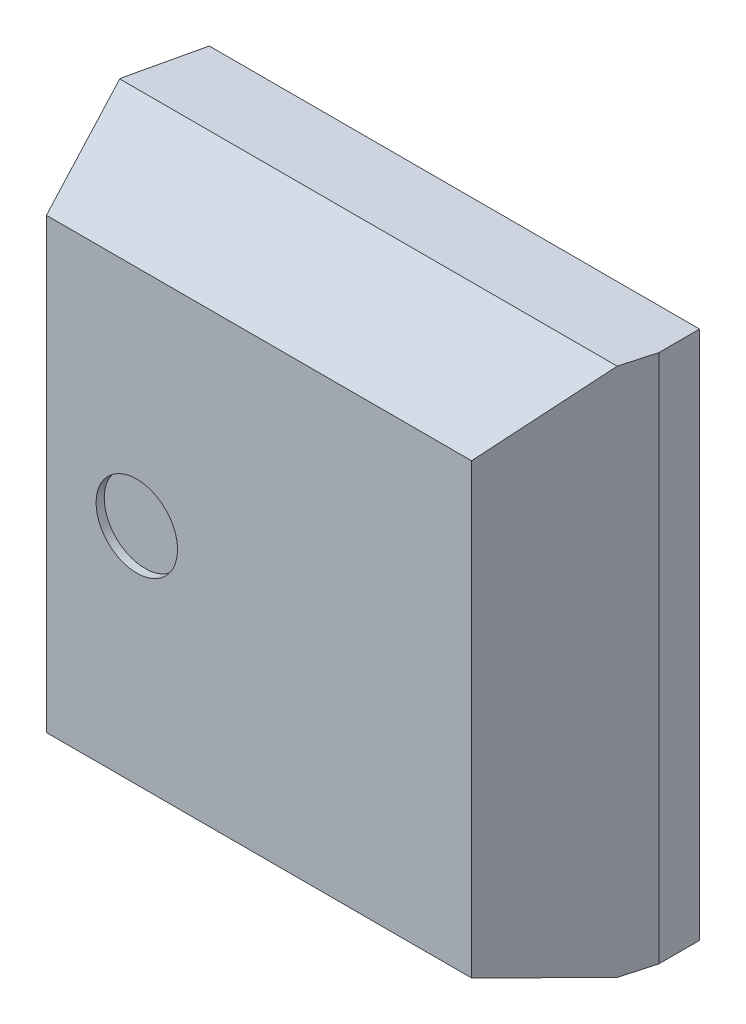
ISO-10303-21;
HEADER;
FILE_DESCRIPTION(('STEP AP214'),'2;1');
FILE_NAME('part.step','',(''),(''),'','','');
FILE_SCHEMA(('AUTOMOTIVE_DESIGN { 1 0 10303 214 1 1 1 1 }'));
ENDSEC;
DATA;
#1=APPLICATION_CONTEXT('core data for automotive mechanical design processes');
#2=APPLICATION_PROTOCOL_DEFINITION('international standard','automotive_design',2000,#1);
#3=PRODUCT_CONTEXT('',#1,'mechanical');
#4=PRODUCT('Part','Part','',(#3));
#5=PRODUCT_RELATED_PRODUCT_CATEGORY('part','',(#4));
#6=PRODUCT_DEFINITION_FORMATION('','',#4);
#7=PRODUCT_DEFINITION_CONTEXT('part definition',#1,'design');
#8=PRODUCT_DEFINITION('design','',#6,#7);
#9=PRODUCT_DEFINITION_SHAPE('','',#8);
#10=(LENGTH_UNIT() NAMED_UNIT(*) SI_UNIT(.MILLI.,.METRE.));
#11=(NAMED_UNIT(*) PLANE_ANGLE_UNIT() SI_UNIT($,.RADIAN.));
#12=(NAMED_UNIT(*) SI_UNIT($,.STERADIAN.) SOLID_ANGLE_UNIT());
#13=UNCERTAINTY_MEASURE_WITH_UNIT(LENGTH_MEASURE(1.E-05),#10,'distance_accuracy_value','');
#14=(GEOMETRIC_REPRESENTATION_CONTEXT(3) GLOBAL_UNCERTAINTY_ASSIGNED_CONTEXT((#13)) GLOBAL_UNIT_ASSIGNED_CONTEXT((#10,
#11,#12)) REPRESENTATION_CONTEXT('',''));
#15=CARTESIAN_POINT('',(0.,0.,0.));
#16=DIRECTION('',(0.,0.,1.));
#17=DIRECTION('',(1.,0.,0.));
#18=AXIS2_PLACEMENT_3D('',#15,#16,#17);
#19=CARTESIAN_POINT('',(-1.5,0.,2.22));
#20=DIRECTION('',(0.,0.,-1.));
#21=DIRECTION('',(-1.,0.,0.));
#22=AXIS2_PLACEMENT_3D('',#19,#20,#21);
#23=PLANE('',#22);
#24=CARTESIAN_POINT('',(-1.5,0.,2.22));
#25=DIRECTION('',(0.,0.,-1.));
#26=DIRECTION('',(-1.,0.,0.));
#27=AXIS2_PLACEMENT_3D('',#24,#25,#26);
#28=CIRCLE('',#27,0.5);
#29=CARTESIAN_POINT('',(-2.,0.,2.22));
#30=VERTEX_POINT('',#29);
#31=EDGE_CURVE('E20',#30,#30,#28,.F.);
#32=ORIENTED_EDGE('',*,*,#31,.T.);
#33=EDGE_LOOP('',(#32));
#34=FACE_BOUND('',#33,.T.);
#35=ADVANCED_FACE('F17',(#34),#23,.F.);
#36=CARTESIAN_POINT('',(-1.5,0.,2.32));
#37=DIRECTION('',(0.,0.,-1.));
#38=DIRECTION('',(-1.,0.,0.));
#39=AXIS2_PLACEMENT_3D('',#36,#37,#38);
#40=CYLINDRICAL_SURFACE('',#39,0.5);
#41=CARTESIAN_POINT('',(-1.5,0.,2.32));
#42=DIRECTION('',(0.,0.,-1.));
#43=DIRECTION('',(-1.,0.,0.));
#44=AXIS2_PLACEMENT_3D('',#41,#42,#43);
#45=CIRCLE('',#44,0.5);
#46=CARTESIAN_POINT('',(-2.,0.,2.32));
#47=VERTEX_POINT('',#46);
#48=EDGE_CURVE('E90',#47,#47,#45,.T.);
#49=ORIENTED_EDGE('',*,*,#48,.F.);
#50=EDGE_LOOP('',(#49));
#51=FACE_BOUND('',#50,.T.);
#52=ORIENTED_EDGE('',*,*,#31,.F.);
#53=EDGE_LOOP('',(#52));
#54=FACE_BOUND('',#53,.T.);
#55=ADVANCED_FACE('F112',(#51,#54),#40,.F.);
#56=CARTESIAN_POINT('',(0.,0.,2.32));
#57=DIRECTION('',(0.,0.,1.));
#58=DIRECTION('',(1.,0.,0.));
#59=AXIS2_PLACEMENT_3D('',#56,#57,#58);
#60=PLANE('',#59);
#61=ORIENTED_EDGE('',*,*,#48,.T.);
#62=EDGE_LOOP('',(#61));
#63=FACE_BOUND('',#62,.T.);
#64=DIRECTION('',(0.,1.,0.));
#65=VECTOR('',#64,1.);
#66=CARTESIAN_POINT('',(2.6100000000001,-3.25,2.32000000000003));
#67=LINE('',#66,#65);
#68=CARTESIAN_POINT('',(2.61000000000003,-2.75000000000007,2.32000000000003));
#69=VERTEX_POINT('',#68);
#70=CARTESIAN_POINT('',(2.61000000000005,2.75000000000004,2.32000000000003));
#71=VERTEX_POINT('',#70);
#72=EDGE_CURVE('E245',#69,#71,#67,.T.);
#73=ORIENTED_EDGE('',*,*,#72,.T.);
#74=DIRECTION('',(1.,0.,0.));
#75=VECTOR('',#74,1.);
#76=CARTESIAN_POINT('',(2.61,2.75000000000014,2.32000000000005));
#77=LINE('',#76,#75);
#78=CARTESIAN_POINT('',(-2.61000000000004,2.75000000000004,2.32000000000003));
#79=VERTEX_POINT('',#78);
#80=EDGE_CURVE('E84',#71,#79,#77,.F.);
#81=ORIENTED_EDGE('',*,*,#80,.T.);
#82=DIRECTION('',(0.,1.,0.));
#83=VECTOR('',#82,1.);
#84=CARTESIAN_POINT('',(-2.61000000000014,3.25,2.32000000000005));
#85=LINE('',#84,#83);
#86=CARTESIAN_POINT('',(-2.61000000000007,-2.75000000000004,2.32000000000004));
#87=VERTEX_POINT('',#86);
#88=EDGE_CURVE('E81',#79,#87,#85,.F.);
#89=ORIENTED_EDGE('',*,*,#88,.T.);
#90=DIRECTION('',(1.,0.,0.));
#91=VECTOR('',#90,1.);
#92=CARTESIAN_POINT('',(-2.61,-2.75000000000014,2.32000000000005));
#93=LINE('',#92,#91);
#94=EDGE_CURVE('E78',#87,#69,#93,.T.);
#95=ORIENTED_EDGE('',*,*,#94,.T.);
#96=EDGE_LOOP('',(#73,#81,#89,#95));
#97=FACE_BOUND('',#96,.T.);
#98=ADVANCED_FACE('F82',(#63,#97),#60,.T.);
#99=CARTESIAN_POINT('',(-2.86,3.25,1.62));
#100=DIRECTION('',(0.941741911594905,0.,-0.336336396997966));
#101=DIRECTION('',(-0.336336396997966,0.,-0.941741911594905));
#102=AXIS2_PLACEMENT_3D('',#99,#100,#101);
#103=PLANE('',#102);
#104=DIRECTION('',(0.,1.,0.));
#105=VECTOR('',#104,1.);
#106=CARTESIAN_POINT('',(-3.11,3.25,0.92));
#107=LINE('',#106,#105);
#108=CARTESIAN_POINT('',(-3.10999999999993,3.24999999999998,0.919999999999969));
#109=VERTEX_POINT('',#108);
#110=CARTESIAN_POINT('',(-3.10999999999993,-3.24999999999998,0.919999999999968));
#111=VERTEX_POINT('',#110);
#112=EDGE_CURVE('E101',#109,#111,#107,.F.);
#113=ORIENTED_EDGE('',*,*,#112,.T.);
#114=DIRECTION('',(0.318788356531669,0.318788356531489,0.892607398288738));
#115=VECTOR('',#114,1.);
#116=CARTESIAN_POINT('',(-3.11,-3.24999999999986,0.919999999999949));
#117=LINE('',#116,#115);
#118=EDGE_CURVE('E89',#111,#87,#117,.T.);
#119=ORIENTED_EDGE('',*,*,#118,.T.);
#120=ORIENTED_EDGE('',*,*,#88,.F.);
#121=DIRECTION('',(-0.318788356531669,0.318788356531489,-0.892607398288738));
#122=VECTOR('',#121,1.);
#123=CARTESIAN_POINT('',(-2.61,2.75000000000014,2.32000000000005));
#124=LINE('',#123,#122);
#125=EDGE_CURVE('E259',#79,#109,#124,.T.);
#126=ORIENTED_EDGE('',*,*,#125,.T.);
#127=EDGE_LOOP('',(#113,#119,#120,#126));
#128=FACE_BOUND('',#127,.T.);
#129=ADVANCED_FACE('F100',(#128),#103,.F.);
#130=CARTESIAN_POINT('',(-2.61,-3.,1.62));
#131=DIRECTION('',(0.,0.941741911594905,-0.336336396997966));
#132=DIRECTION('',(0.,0.336336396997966,0.941741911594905));
#133=AXIS2_PLACEMENT_3D('',#130,#131,#132);
#134=PLANE('',#133);
#135=DIRECTION('',(-0.253078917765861,0.325387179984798,0.911084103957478));
#136=VECTOR('',#135,1.);
#137=CARTESIAN_POINT('',(2.99888888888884,-3.25,0.919999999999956));
#138=LINE('',#137,#136);
#139=CARTESIAN_POINT('',(2.99888888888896,-3.24999999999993,0.919999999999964));
#140=VERTEX_POINT('',#139);
#141=EDGE_CURVE('E97',#140,#69,#138,.T.);
#142=ORIENTED_EDGE('',*,*,#141,.T.);
#143=ORIENTED_EDGE('',*,*,#94,.F.);
#144=ORIENTED_EDGE('',*,*,#118,.F.);
#145=DIRECTION('',(1.,0.,0.));
#146=VECTOR('',#145,1.);
#147=CARTESIAN_POINT('',(-3.11,-3.25,0.92));
#148=LINE('',#147,#146);
#149=EDGE_CURVE('E249',#111,#140,#148,.T.);
#150=ORIENTED_EDGE('',*,*,#149,.T.);
#151=EDGE_LOOP('',(#142,#143,#144,#150));
#152=FACE_BOUND('',#151,.T.);
#153=ADVANCED_FACE('F94',(#152),#134,.F.);
#154=CARTESIAN_POINT('',(2.86,-3.25,1.42));
#155=DIRECTION('',(-0.963517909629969,0.,-0.267643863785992));
#156=DIRECTION('',(-0.267643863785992,0.,0.963517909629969));
#157=AXIS2_PLACEMENT_3D('',#154,#155,#156);
#158=PLANE('',#157);
#159=ORIENTED_EDGE('',*,*,#141,.F.);
#160=DIRECTION('',(0.267643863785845,0.,-0.96351790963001));
#161=VECTOR('',#160,1.);
#162=CARTESIAN_POINT('',(2.998888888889,-3.25,0.92));
#163=LINE('',#162,#161);
#164=CARTESIAN_POINT('',(3.10999999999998,-3.25,0.519999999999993));
#165=VERTEX_POINT('',#164);
#166=EDGE_CURVE('E242',#140,#165,#163,.T.);
#167=ORIENTED_EDGE('',*,*,#166,.T.);
#168=DIRECTION('',(0.,1.,0.));
#169=VECTOR('',#168,1.);
#170=CARTESIAN_POINT('',(3.11,-3.25,0.52));
#171=LINE('',#170,#169);
#172=CARTESIAN_POINT('',(3.10999999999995,3.25,0.519999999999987));
#173=VERTEX_POINT('',#172);
#174=EDGE_CURVE('E272',#165,#173,#171,.T.);
#175=ORIENTED_EDGE('',*,*,#174,.T.);
#176=DIRECTION('',(-0.267643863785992,0.,0.963517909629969));
#177=VECTOR('',#176,1.);
#178=CARTESIAN_POINT('',(2.86,3.25,1.42));
#179=LINE('',#178,#177);
#180=CARTESIAN_POINT('',(2.99888888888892,3.24999999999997,0.919999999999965));
#181=VERTEX_POINT('',#180);
#182=EDGE_CURVE('E98',#181,#173,#179,.F.);
#183=ORIENTED_EDGE('',*,*,#182,.F.);
#184=DIRECTION('',(-0.253078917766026,-0.325387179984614,0.911084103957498));
#185=VECTOR('',#184,1.);
#186=CARTESIAN_POINT('',(2.998888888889,3.24999999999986,0.919999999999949));
#187=LINE('',#186,#185);
#188=EDGE_CURVE('E262',#181,#71,#187,.T.);
#189=ORIENTED_EDGE('',*,*,#188,.T.);
#190=ORIENTED_EDGE('',*,*,#72,.F.);
#191=EDGE_LOOP('',(#159,#167,#175,#183,#189,#190));
#192=FACE_BOUND('',#191,.T.);
#193=ADVANCED_FACE('F151',(#192),#158,.F.);
#194=CARTESIAN_POINT('',(2.61,3.,1.62));
#195=DIRECTION('',(0.,-0.941741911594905,-0.336336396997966));
#196=DIRECTION('',(0.,0.336336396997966,-0.941741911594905));
#197=AXIS2_PLACEMENT_3D('',#194,#195,#196);
#198=PLANE('',#197);
#199=ORIENTED_EDGE('',*,*,#125,.F.);
#200=ORIENTED_EDGE('',*,*,#80,.F.);
#201=ORIENTED_EDGE('',*,*,#188,.F.);
#202=DIRECTION('',(1.,0.,0.));
#203=VECTOR('',#202,1.);
#204=CARTESIAN_POINT('',(3.11,3.25,0.92));
#205=LINE('',#204,#203);
#206=EDGE_CURVE('E270',#181,#109,#205,.F.);
#207=ORIENTED_EDGE('',*,*,#206,.T.);
#208=EDGE_LOOP('',(#199,#200,#201,#207));
#209=FACE_BOUND('',#208,.T.);
#210=ADVANCED_FACE('F147',(#209),#198,.F.);
#211=CARTESIAN_POINT('',(-3.11,3.25,0.02));
#212=DIRECTION('',(1.,0.,0.));
#213=DIRECTION('',(0.,0.,-1.));
#214=AXIS2_PLACEMENT_3D('',#211,#212,#213);
#215=PLANE('',#214);
#216=DIRECTION('',(0.,0.,1.));
#217=VECTOR('',#216,1.);
#218=CARTESIAN_POINT('',(-3.11,-3.25,0.02));
#219=LINE('',#218,#217);
#220=CARTESIAN_POINT('',(-3.11000000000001,-3.25,0.899999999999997));
#221=VERTEX_POINT('',#220);
#222=EDGE_CURVE('E253',#221,#111,#219,.T.);
#223=ORIENTED_EDGE('',*,*,#222,.T.);
#224=ORIENTED_EDGE('',*,*,#112,.F.);
#225=DIRECTION('',(0.,0.,-1.));
#226=VECTOR('',#225,1.);
#227=CARTESIAN_POINT('',(-3.11,3.25,0.02));
#228=LINE('',#227,#226);
#229=CARTESIAN_POINT('',(-3.11000000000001,3.25,0.899999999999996));
#230=VERTEX_POINT('',#229);
#231=EDGE_CURVE('E273',#109,#230,#228,.T.);
#232=ORIENTED_EDGE('',*,*,#231,.T.);
#233=DIRECTION('',(0.,1.,0.));
#234=VECTOR('',#233,1.);
#235=CARTESIAN_POINT('',(-3.11000000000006,3.25,0.899999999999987));
#236=LINE('',#235,#234);
#237=EDGE_CURVE('E286',#221,#230,#236,.T.);
#238=ORIENTED_EDGE('',*,*,#237,.F.);
#239=EDGE_LOOP('',(#223,#224,#232,#238));
#240=FACE_BOUND('',#239,.T.);
#241=ADVANCED_FACE('F143',(#240),#215,.F.);
#242=CARTESIAN_POINT('',(-3.11,-3.25,0.02));
#243=DIRECTION('',(0.,1.,0.));
#244=DIRECTION('',(0.,0.,1.));
#245=AXIS2_PLACEMENT_3D('',#242,#243,#244);
#246=PLANE('',#245);
#247=DIRECTION('',(1.,0.,0.));
#248=VECTOR('',#247,1.);
#249=CARTESIAN_POINT('',(0.,-3.25,0.02));
#250=LINE('',#249,#248);
#251=CARTESIAN_POINT('',(-2.90999999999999,-3.25,0.0200000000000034));
#252=VERTEX_POINT('',#251);
#253=CARTESIAN_POINT('',(3.11,-3.25,0.02));
#254=VERTEX_POINT('',#253);
#255=EDGE_CURVE('E289',#252,#254,#250,.T.);
#256=ORIENTED_EDGE('',*,*,#255,.T.);
#257=DIRECTION('',(0.,0.,1.));
#258=VECTOR('',#257,1.);
#259=CARTESIAN_POINT('',(3.11,-3.25,0.02));
#260=LINE('',#259,#258);
#261=EDGE_CURVE('E251',#254,#165,#260,.T.);
#262=ORIENTED_EDGE('',*,*,#261,.T.);
#263=ORIENTED_EDGE('',*,*,#166,.F.);
#264=ORIENTED_EDGE('',*,*,#149,.F.);
#265=ORIENTED_EDGE('',*,*,#222,.F.);
#266=DIRECTION('',(-0.221621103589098,0.,0.97513285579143));
#267=VECTOR('',#266,1.);
#268=CARTESIAN_POINT('',(-3.01,-3.25,0.46));
#269=LINE('',#268,#267);
#270=EDGE_CURVE('E279',#252,#221,#269,.T.);
#271=ORIENTED_EDGE('',*,*,#270,.F.);
#272=EDGE_LOOP('',(#256,#262,#263,#264,#265,#271));
#273=FACE_BOUND('',#272,.T.);
#274=ADVANCED_FACE('F139',(#273),#246,.F.);
#275=CARTESIAN_POINT('',(3.11,-3.25,0.02));
#276=DIRECTION('',(-1.,0.,0.));
#277=DIRECTION('',(0.,0.,1.));
#278=AXIS2_PLACEMENT_3D('',#275,#276,#277);
#279=PLANE('',#278);
#280=DIRECTION('',(0.,0.,-1.));
#281=VECTOR('',#280,1.);
#282=CARTESIAN_POINT('',(3.11,3.25,0.02));
#283=LINE('',#282,#281);
#284=CARTESIAN_POINT('',(3.11,3.25,0.02));
#285=VERTEX_POINT('',#284);
#286=EDGE_CURVE('E267',#285,#173,#283,.F.);
#287=ORIENTED_EDGE('',*,*,#286,.T.);
#288=ORIENTED_EDGE('',*,*,#174,.F.);
#289=ORIENTED_EDGE('',*,*,#261,.F.);
#290=DIRECTION('',(0.,1.,0.));
#291=VECTOR('',#290,1.);
#292=CARTESIAN_POINT('',(3.11,0.,0.02));
#293=LINE('',#292,#291);
#294=EDGE_CURVE('E277',#254,#285,#293,.T.);
#295=ORIENTED_EDGE('',*,*,#294,.T.);
#296=EDGE_LOOP('',(#287,#288,#289,#295));
#297=FACE_BOUND('',#296,.T.);
#298=ADVANCED_FACE('F135',(#297),#279,.F.);
#299=CARTESIAN_POINT('',(3.11,3.25,0.02));
#300=DIRECTION('',(0.,-1.,0.));
#301=DIRECTION('',(0.,0.,-1.));
#302=AXIS2_PLACEMENT_3D('',#299,#300,#301);
#303=PLANE('',#302);
#304=ORIENTED_EDGE('',*,*,#182,.T.);
#305=ORIENTED_EDGE('',*,*,#286,.F.);
#306=DIRECTION('',(1.,0.,0.));
#307=VECTOR('',#306,1.);
#308=CARTESIAN_POINT('',(0.,3.25,0.02));
#309=LINE('',#308,#307);
#310=CARTESIAN_POINT('',(-2.90999999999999,3.25,0.0200000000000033));
#311=VERTEX_POINT('',#310);
#312=EDGE_CURVE('E26',#285,#311,#309,.F.);
#313=ORIENTED_EDGE('',*,*,#312,.T.);
#314=DIRECTION('',(-0.221621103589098,0.,0.97513285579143));
#315=VECTOR('',#314,1.);
#316=CARTESIAN_POINT('',(-3.01,3.25,0.46));
#317=LINE('',#316,#315);
#318=EDGE_CURVE('E34',#230,#311,#317,.F.);
#319=ORIENTED_EDGE('',*,*,#318,.F.);
#320=ORIENTED_EDGE('',*,*,#231,.F.);
#321=ORIENTED_EDGE('',*,*,#206,.F.);
#322=EDGE_LOOP('',(#304,#305,#313,#319,#320,#321));
#323=FACE_BOUND('',#322,.T.);
#324=ADVANCED_FACE('F129',(#323),#303,.F.);
#325=CARTESIAN_POINT('',(-3.01,3.25,0.46));
#326=DIRECTION('',(-0.97513285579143,0.,-0.221621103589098));
#327=DIRECTION('',(-0.221621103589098,0.,0.97513285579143));
#328=AXIS2_PLACEMENT_3D('',#325,#326,#327);
#329=PLANE('',#328);
#330=ORIENTED_EDGE('',*,*,#237,.T.);
#331=ORIENTED_EDGE('',*,*,#318,.T.);
#332=DIRECTION('',(0.,1.,0.));
#333=VECTOR('',#332,1.);
#334=CARTESIAN_POINT('',(-2.91,0.,0.02));
#335=LINE('',#334,#333);
#336=EDGE_CURVE('E11',#311,#252,#335,.F.);
#337=ORIENTED_EDGE('',*,*,#336,.T.);
#338=ORIENTED_EDGE('',*,*,#270,.T.);
#339=EDGE_LOOP('',(#330,#331,#337,#338));
#340=FACE_BOUND('',#339,.T.);
#341=ADVANCED_FACE('F123',(#340),#329,.T.);
#342=CARTESIAN_POINT('',(0.,0.,0.02));
#343=DIRECTION('',(0.,0.,1.));
#344=DIRECTION('',(1.,0.,0.));
#345=AXIS2_PLACEMENT_3D('',#342,#343,#344);
#346=PLANE('',#345);
#347=ORIENTED_EDGE('',*,*,#312,.F.);
#348=ORIENTED_EDGE('',*,*,#294,.F.);
#349=ORIENTED_EDGE('',*,*,#255,.F.);
#350=ORIENTED_EDGE('',*,*,#336,.F.);
#351=EDGE_LOOP('',(#347,#348,#349,#350));
#352=FACE_BOUND('',#351,.T.);
#353=ADVANCED_FACE('F121',(#352),#346,.F.);
#354=CLOSED_SHELL('',(#35,#55,#98,#129,#153,#193,#210,#241,#274,#298,#324,#341,#353));
#355=MANIFOLD_SOLID_BREP('B1',#354);
#356=ADVANCED_BREP_SHAPE_REPRESENTATION('',(#18,#355),#14);
#357=SHAPE_DEFINITION_REPRESENTATION(#9,#356);
ENDSEC;
END-ISO-10303-21;
